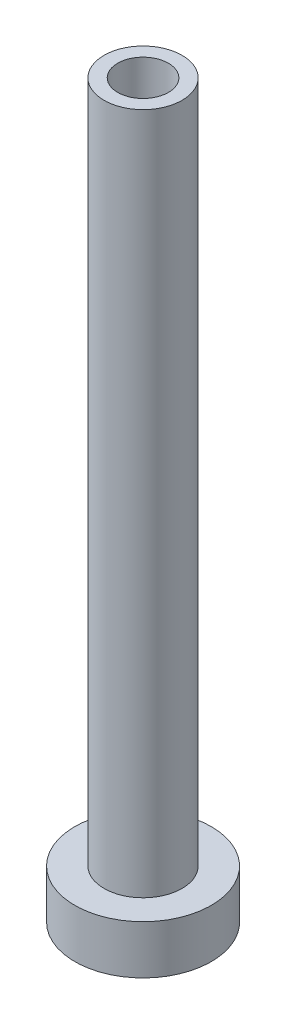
ISO-10303-21;
HEADER;
FILE_DESCRIPTION(('STEP AP214'),'2;1');
FILE_NAME('part.step','',(''),(''),'','','');
FILE_SCHEMA(('AUTOMOTIVE_DESIGN { 1 0 10303 214 1 1 1 1 }'));
ENDSEC;
DATA;
#1=APPLICATION_CONTEXT('core data for automotive mechanical design processes');
#2=APPLICATION_PROTOCOL_DEFINITION('international standard','automotive_design',2000,#1);
#3=PRODUCT_CONTEXT('',#1,'mechanical');
#4=PRODUCT('Part','Part','',(#3));
#5=PRODUCT_RELATED_PRODUCT_CATEGORY('part','',(#4));
#6=PRODUCT_DEFINITION_FORMATION('','',#4);
#7=PRODUCT_DEFINITION_CONTEXT('part definition',#1,'design');
#8=PRODUCT_DEFINITION('design','',#6,#7);
#9=PRODUCT_DEFINITION_SHAPE('','',#8);
#10=(LENGTH_UNIT() NAMED_UNIT(*) SI_UNIT(.MILLI.,.METRE.));
#11=(NAMED_UNIT(*) PLANE_ANGLE_UNIT() SI_UNIT($,.RADIAN.));
#12=(NAMED_UNIT(*) SI_UNIT($,.STERADIAN.) SOLID_ANGLE_UNIT());
#13=UNCERTAINTY_MEASURE_WITH_UNIT(LENGTH_MEASURE(1.E-05),#10,'distance_accuracy_value','');
#14=(GEOMETRIC_REPRESENTATION_CONTEXT(3) GLOBAL_UNCERTAINTY_ASSIGNED_CONTEXT((#13)) GLOBAL_UNIT_ASSIGNED_CONTEXT((#10,
#11,#12)) REPRESENTATION_CONTEXT('',''));
#15=CARTESIAN_POINT('',(0.,0.,0.));
#16=DIRECTION('',(0.,0.,1.));
#17=DIRECTION('',(1.,0.,0.));
#18=AXIS2_PLACEMENT_3D('',#15,#16,#17);
#19=CARTESIAN_POINT('',(0.,0.,0.));
#20=DIRECTION('',(0.,-1.,0.));
#21=DIRECTION('',(0.,0.,-1.));
#22=AXIS2_PLACEMENT_3D('',#19,#20,#21);
#23=CYLINDRICAL_SURFACE('',#22,7.);
#24=CARTESIAN_POINT('',(0.,-5.,0.));
#25=DIRECTION('',(0.,-1.,0.));
#26=DIRECTION('',(0.,0.,-1.));
#27=AXIS2_PLACEMENT_3D('',#24,#25,#26);
#28=CIRCLE('',#27,7.);
#29=CARTESIAN_POINT('',(0.,-5.,-7.));
#30=VERTEX_POINT('',#29);
#31=EDGE_CURVE('E42',#30,#30,#28,.T.);
#32=ORIENTED_EDGE('',*,*,#31,.F.);
#33=EDGE_LOOP('',(#32));
#34=FACE_BOUND('',#33,.T.);
#35=CARTESIAN_POINT('',(0.,0.,0.));
#36=DIRECTION('',(0.,-1.,0.));
#37=DIRECTION('',(0.,0.,-1.));
#38=AXIS2_PLACEMENT_3D('',#35,#36,#37);
#39=CIRCLE('',#38,7.);
#40=CARTESIAN_POINT('',(0.,0.,-7.));
#41=VERTEX_POINT('',#40);
#42=EDGE_CURVE('E9',#41,#41,#39,.T.);
#43=ORIENTED_EDGE('',*,*,#42,.T.);
#44=EDGE_LOOP('',(#43));
#45=FACE_BOUND('',#44,.T.);
#46=ADVANCED_FACE('F14',(#34,#45),#23,.T.);
#47=CARTESIAN_POINT('',(-7.,0.,0.));
#48=DIRECTION('',(0.,-1.,0.));
#49=DIRECTION('',(0.,0.,-1.));
#50=AXIS2_PLACEMENT_3D('',#47,#48,#49);
#51=PLANE('',#50);
#52=ORIENTED_EDGE('',*,*,#42,.F.);
#53=EDGE_LOOP('',(#52));
#54=FACE_BOUND('',#53,.T.);
#55=CARTESIAN_POINT('',(0.,0.,0.));
#56=DIRECTION('',(0.,-1.,0.));
#57=DIRECTION('',(0.,0.,-1.));
#58=AXIS2_PLACEMENT_3D('',#55,#56,#57);
#59=CIRCLE('',#58,4.);
#60=CARTESIAN_POINT('',(0.,0.,-4.));
#61=VERTEX_POINT('',#60);
#62=EDGE_CURVE('E20',#61,#61,#59,.T.);
#63=ORIENTED_EDGE('',*,*,#62,.T.);
#64=EDGE_LOOP('',(#63));
#65=FACE_BOUND('',#64,.T.);
#66=ADVANCED_FACE('F49',(#54,#65),#51,.F.);
#67=CARTESIAN_POINT('',(0.,0.,0.));
#68=DIRECTION('',(0.,-1.,0.));
#69=DIRECTION('',(0.,0.,-1.));
#70=AXIS2_PLACEMENT_3D('',#67,#68,#69);
#71=CYLINDRICAL_SURFACE('',#70,4.);
#72=ORIENTED_EDGE('',*,*,#62,.F.);
#73=EDGE_LOOP('',(#72));
#74=FACE_BOUND('',#73,.T.);
#75=CARTESIAN_POINT('',(0.,70.,0.));
#76=DIRECTION('',(0.,-1.,0.));
#77=DIRECTION('',(0.,0.,-1.));
#78=AXIS2_PLACEMENT_3D('',#75,#76,#77);
#79=CIRCLE('',#78,4.);
#80=CARTESIAN_POINT('',(0.,70.,-4.));
#81=VERTEX_POINT('',#80);
#82=EDGE_CURVE('E24',#81,#81,#79,.T.);
#83=ORIENTED_EDGE('',*,*,#82,.T.);
#84=EDGE_LOOP('',(#83));
#85=FACE_BOUND('',#84,.T.);
#86=ADVANCED_FACE('F55',(#74,#85),#71,.T.);
#87=CARTESIAN_POINT('',(-4.,70.,0.));
#88=DIRECTION('',(0.,-1.,0.));
#89=DIRECTION('',(0.,0.,-1.));
#90=AXIS2_PLACEMENT_3D('',#87,#88,#89);
#91=PLANE('',#90);
#92=ORIENTED_EDGE('',*,*,#82,.F.);
#93=EDGE_LOOP('',(#92));
#94=FACE_BOUND('',#93,.T.);
#95=CARTESIAN_POINT('',(0.,70.,0.));
#96=DIRECTION('',(0.,-1.,0.));
#97=DIRECTION('',(0.,0.,-1.));
#98=AXIS2_PLACEMENT_3D('',#95,#96,#97);
#99=CIRCLE('',#98,2.6);
#100=CARTESIAN_POINT('',(0.,70.,-2.6));
#101=VERTEX_POINT('',#100);
#102=EDGE_CURVE('E28',#101,#101,#99,.T.);
#103=ORIENTED_EDGE('',*,*,#102,.T.);
#104=EDGE_LOOP('',(#103));
#105=FACE_BOUND('',#104,.T.);
#106=ADVANCED_FACE('F61',(#94,#105),#91,.F.);
#107=CARTESIAN_POINT('',(0.,0.,0.));
#108=DIRECTION('',(0.,-1.,0.));
#109=DIRECTION('',(0.,0.,-1.));
#110=AXIS2_PLACEMENT_3D('',#107,#108,#109);
#111=CYLINDRICAL_SURFACE('',#110,2.6);
#112=ORIENTED_EDGE('',*,*,#102,.F.);
#113=EDGE_LOOP('',(#112));
#114=FACE_BOUND('',#113,.T.);
#115=CARTESIAN_POINT('',(0.,25.,0.));
#116=DIRECTION('',(0.,-1.,0.));
#117=DIRECTION('',(0.,0.,-1.));
#118=AXIS2_PLACEMENT_3D('',#115,#116,#117);
#119=CIRCLE('',#118,2.6);
#120=CARTESIAN_POINT('',(0.,25.,-2.6));
#121=VERTEX_POINT('',#120);
#122=EDGE_CURVE('E33',#121,#121,#119,.T.);
#123=ORIENTED_EDGE('',*,*,#122,.T.);
#124=EDGE_LOOP('',(#123));
#125=FACE_BOUND('',#124,.T.);
#126=ADVANCED_FACE('F67',(#114,#125),#111,.F.);
#127=CARTESIAN_POINT('',(0.,24.85,0.));
#128=DIRECTION('',(0.,-1.,0.));
#129=DIRECTION('',(0.,0.,-1.));
#130=AXIS2_PLACEMENT_3D('',#127,#128,#129);
#131=CONICAL_SURFACE('',#130,2.75,0.785398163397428);
#132=ORIENTED_EDGE('',*,*,#122,.F.);
#133=EDGE_LOOP('',(#132));
#134=FACE_BOUND('',#133,.T.);
#135=CARTESIAN_POINT('',(0.,24.85,0.));
#136=DIRECTION('',(0.,-1.,0.));
#137=DIRECTION('',(0.,0.,-1.));
#138=AXIS2_PLACEMENT_3D('',#135,#136,#137);
#139=CIRCLE('',#138,2.75);
#140=CARTESIAN_POINT('',(0.,24.85,-2.75));
#141=VERTEX_POINT('',#140);
#142=EDGE_CURVE('E36',#141,#141,#139,.T.);
#143=ORIENTED_EDGE('',*,*,#142,.T.);
#144=EDGE_LOOP('',(#143));
#145=FACE_BOUND('',#144,.T.);
#146=ADVANCED_FACE('F71',(#134,#145),#131,.F.);
#147=CARTESIAN_POINT('',(0.,0.,0.));
#148=DIRECTION('',(0.,-1.,0.));
#149=DIRECTION('',(0.,0.,-1.));
#150=AXIS2_PLACEMENT_3D('',#147,#148,#149);
#151=CYLINDRICAL_SURFACE('',#150,2.75);
#152=ORIENTED_EDGE('',*,*,#142,.F.);
#153=EDGE_LOOP('',(#152));
#154=FACE_BOUND('',#153,.T.);
#155=CARTESIAN_POINT('',(0.,-5.,0.));
#156=DIRECTION('',(0.,-1.,0.));
#157=DIRECTION('',(0.,0.,-1.));
#158=AXIS2_PLACEMENT_3D('',#155,#156,#157);
#159=CIRCLE('',#158,2.75);
#160=CARTESIAN_POINT('',(0.,-5.,-2.75));
#161=VERTEX_POINT('',#160);
#162=EDGE_CURVE('E39',#161,#161,#159,.T.);
#163=ORIENTED_EDGE('',*,*,#162,.T.);
#164=EDGE_LOOP('',(#163));
#165=FACE_BOUND('',#164,.T.);
#166=ADVANCED_FACE('F75',(#154,#165),#151,.F.);
#167=CARTESIAN_POINT('',(-2.75,-5.,0.));
#168=DIRECTION('',(0.,1.,0.));
#169=DIRECTION('',(0.,0.,1.));
#170=AXIS2_PLACEMENT_3D('',#167,#168,#169);
#171=PLANE('',#170);
#172=ORIENTED_EDGE('',*,*,#162,.F.);
#173=EDGE_LOOP('',(#172));
#174=FACE_BOUND('',#173,.T.);
#175=ORIENTED_EDGE('',*,*,#31,.T.);
#176=EDGE_LOOP('',(#175));
#177=FACE_BOUND('',#176,.T.);
#178=ADVANCED_FACE('F46',(#174,#177),#171,.F.);
#179=CLOSED_SHELL('',(#46,#66,#86,#106,#126,#146,#166,#178));
#180=MANIFOLD_SOLID_BREP('B1',#179);
#181=ADVANCED_BREP_SHAPE_REPRESENTATION('',(#18,#180),#14);
#182=SHAPE_DEFINITION_REPRESENTATION(#9,#181);
ENDSEC;
END-ISO-10303-21;
